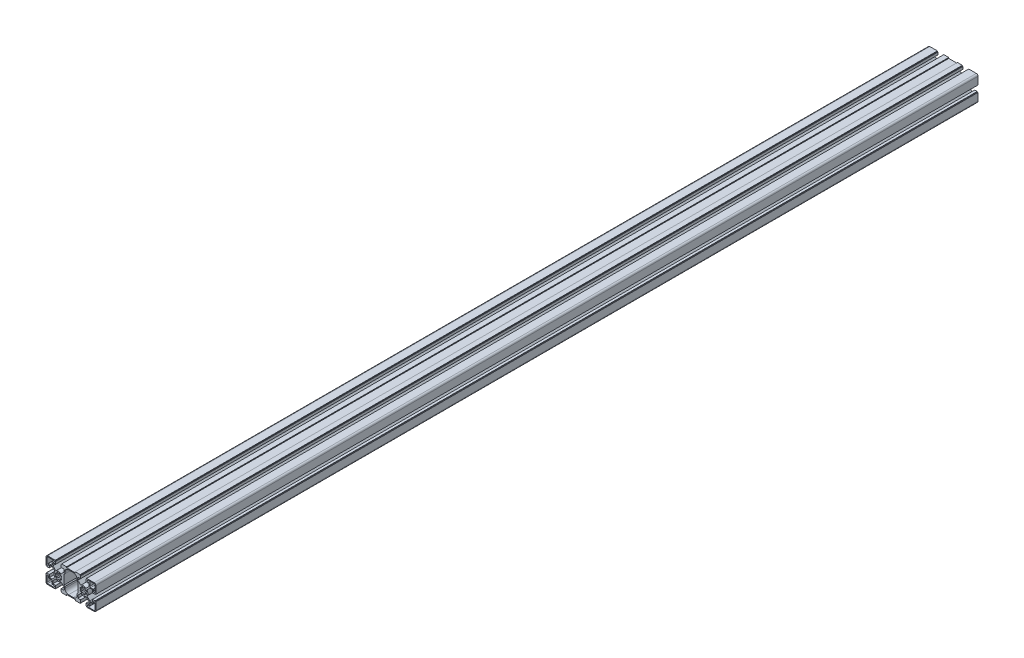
from build123d import *

# Parameters (mm, degrees)
BOSS_EXTRUDE1_DEPTH = 1592.4022


with BuildPart() as part:
    # Sketch1 → Boss-Extrude1 (new body)
    with BuildSketch(Plane.XY):
        with BuildLine():
            Line((-42.0116, 22.5044), (-28.2956, 22.5044))
            Line((-28.2956, 22.5044), (-28.2956, 21.0058))
            Line((-28.2956, 21.0058), (-27.5082, 21.0058))
            Line((-27.5082, 21.0058), (-27.5082, 16.51))
            Line((-27.5082, 16.51), (-32.5501, 16.51))
            Line((-32.5501, 16.51), (-32.5501, 11.680106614))
            Line((-32.5501, 11.680106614), (-27.285426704, 6.415433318))
            ThreePointArc((-27.285426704, 6.415433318), (-22.5044, 8.001), (-17.723373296, 6.415433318))
            Line((-17.723373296, 6.415433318), (-12.4587, 11.680106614))
            Line((-12.4587, 11.680106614), (-12.4587, 16.51))
            Line((-12.4587, 16.51), (-17.5006, 16.51))
            Line((-17.5006, 16.51), (-17.5006, 21.0058))
            Line((-17.5006, 21.0058), (-16.7132, 21.0058))
            Line((-16.7132, 21.0058), (-16.7132, 22.5044))
            Line((-16.7132, 22.5044), (-7.8105, 22.5044))
            Line((-7.8105, 22.5044), (-7.8105, 21.0058))
            Line((-7.8105, 21.0058), (7.8105, 21.0058))
            Line((7.8105, 21.0058), (7.8105, 22.5044))
            Line((7.8105, 22.5044), (16.7132, 22.5044))
            Line((16.7132, 22.5044), (16.7132, 21.0058))
            Line((16.7132, 21.0058), (17.5006, 21.0058))
            Line((17.5006, 21.0058), (17.5006, 16.51))
            Line((17.5006, 16.51), (12.4587, 16.51))
            Line((12.4587, 16.51), (12.4587, 11.680106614))
            Line((12.4587, 11.680106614), (17.723373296, 6.415433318))
            ThreePointArc((17.723373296, 6.415433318), (22.5044, 8.001), (27.285426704, 6.415433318))
            Line((27.285426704, 6.415433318), (32.5501, 11.680106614))
            Line((32.5501, 11.680106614), (32.5501, 16.51))
            Line((32.5501, 16.51), (27.5082, 16.51))
            Line((27.5082, 16.51), (27.5082, 21.0058))
            Line((27.5082, 21.0058), (28.2956, 21.0058))
            Line((28.2956, 21.0058), (28.2956, 22.5044))
            Line((28.2956, 22.5044), (42.0116, 22.5044))
            ThreePointArc((42.0116, 22.5044), (44.130940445, 21.626540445), (45.0088, 19.5072))
            Line((45.0088, 19.5072), (45.0088, 5.7912))
            Line((45.0088, 5.7912), (43.5102, 5.7912))
            Line((43.5102, 5.7912), (43.5102, 5.0038))
            Line((43.5102, 5.0038), (39.0144, 5.0038))
            Line((39.0144, 5.0038), (39.0144, 10.0457))
            Line((39.0144, 10.0457), (34.184506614, 10.0457))
            Line((34.184506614, 10.0457), (28.919833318, 4.781026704))
            ThreePointArc((28.919833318, 4.781026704), (30.5054, 0), (28.919833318, -4.781026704))
            Line((28.919833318, -4.781026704), (34.184506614, -10.0457))
            Line((34.184506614, -10.0457), (39.0144, -10.0457))
            Line((39.0144, -10.0457), (39.0144, -5.0038))
            Line((39.0144, -5.0038), (43.5102, -5.0038))
            Line((43.5102, -5.0038), (43.5102, -5.7912))
            Line((43.5102, -5.7912), (45.0088, -5.7912))
            Line((45.0088, -5.7912), (45.0088, -19.5072))
            ThreePointArc((45.0088, -19.5072), (44.130940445, -21.626540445), (42.0116, -22.5044))
            Line((42.0116, -22.5044), (28.2956, -22.5044))
            Line((28.2956, -22.5044), (28.2956, -21.0058))
            Line((28.2956, -21.0058), (27.5082, -21.0058))
            Line((27.5082, -21.0058), (27.5082, -16.51))
            Line((27.5082, -16.51), (32.5501, -16.51))
            Line((32.5501, -16.51), (32.5501, -11.680106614))
            Line((32.5501, -11.680106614), (27.285426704, -6.415433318))
            ThreePointArc((27.285426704, -6.415433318), (22.5044, -8.001), (17.723373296, -6.415433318))
            Line((17.723373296, -6.415433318), (12.4587, -11.680106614))
            Line((12.4587, -11.680106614), (12.4587, -16.51))
            Line((12.4587, -16.51), (17.5006, -16.51))
            Line((17.5006, -16.51), (17.5006, -21.0058))
            Line((17.5006, -21.0058), (16.7132, -21.0058))
            Line((16.7132, -21.0058), (16.7132, -22.5044))
            Line((16.7132, -22.5044), (7.8105, -22.5044))
            Line((7.8105, -22.5044), (7.8105, -21.0058))
            Line((7.8105, -21.0058), (-7.8105, -21.0058))
            Line((-7.8105, -21.0058), (-7.8105, -22.5044))
            Line((-7.8105, -22.5044), (-16.7132, -22.5044))
            Line((-16.7132, -22.5044), (-16.7132, -21.0058))
            Line((-16.7132, -21.0058), (-17.5006, -21.0058))
            Line((-17.5006, -21.0058), (-17.5006, -16.51))
            Line((-17.5006, -16.51), (-12.4587, -16.51))
            Line((-12.4587, -16.51), (-12.4587, -11.680106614))
            Line((-12.4587, -11.680106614), (-17.723373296, -6.415433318))
            ThreePointArc((-17.723373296, -6.415433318), (-22.5044, -8.001), (-27.285426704, -6.415433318))
            Line((-27.285426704, -6.415433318), (-32.5501, -11.680106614))
            Line((-32.5501, -11.680106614), (-32.5501, -16.51))
            Line((-32.5501, -16.51), (-27.5082, -16.51))
            Line((-27.5082, -16.51), (-27.5082, -21.0058))
            Line((-27.5082, -21.0058), (-28.2956, -21.0058))
            Line((-28.2956, -21.0058), (-28.2956, -22.5044))
            Line((-28.2956, -22.5044), (-42.0116, -22.5044))
            ThreePointArc((-42.0116, -22.5044), (-44.130940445, -21.626540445), (-45.0088, -19.5072))
            Line((-45.0088, -19.5072), (-45.0088, -5.7912))
            Line((-45.0088, -5.7912), (-43.5102, -5.7912))
            Line((-43.5102, -5.7912), (-43.5102, -5.0038))
            Line((-43.5102, -5.0038), (-39.0144, -5.0038))
            Line((-39.0144, -5.0038), (-39.0144, -10.0457))
            Line((-39.0144, -10.0457), (-34.184506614, -10.0457))
            Line((-34.184506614, -10.0457), (-28.919833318, -4.781026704))
            ThreePointArc((-28.919833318, -4.781026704), (-30.5054, 0), (-28.919833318, 4.781026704))
            Line((-28.919833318, 4.781026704), (-34.184506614, 10.0457))
            Line((-34.184506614, 10.0457), (-39.0144, 10.0457))
            Line((-39.0144, 10.0457), (-39.0144, 5.0038))
            Line((-39.0144, 5.0038), (-43.5102, 5.0038))
            Line((-43.5102, 5.0038), (-43.5102, 5.7912))
            Line((-43.5102, 5.7912), (-45.0088, 5.7912))
            Line((-45.0088, 5.7912), (-45.0088, 19.5072))
            ThreePointArc((-45.0088, 19.5072), (-44.130940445, 21.626540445), (-42.0116, 22.5044))
        make_face()
        with BuildLine():
            Line((-40.513, 11.5443), (-35.5473, 11.5443))
            ThreePointArc((-35.5473, 11.5443), (-34.487629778, 11.983229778), (-34.0487, 13.0429))
            Line((-34.0487, 13.0429), (-34.0487, 18.0086))
            Line((-34.0487, 18.0086), (-31.2928, 18.0086))
            ThreePointArc((-31.2928, 18.0086), (-29.7942, 19.5072), (-31.2928, 21.0058))
            Line((-31.2928, 21.0058), (-42.0116, 21.0058))
            ThreePointArc((-42.0116, 21.0058), (-43.071270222, 20.566870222), (-43.5102, 19.5072))
            Line((-43.5102, 19.5072), (-43.5102, 8.7884))
            ThreePointArc((-43.5102, 8.7884), (-42.0116, 7.2898), (-40.513, 8.7884))
            Line((-40.513, 8.7884), (-40.513, 11.5443))
        make_face(mode=Mode.SUBTRACT)
        with BuildLine():
            Line((-21.315129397, 5.978867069), (-21.528207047, 4.907653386))
            ThreePointArc((-21.528207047, 4.907653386), (-22.5044, 5.0038), (-23.480592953, 4.907653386))
            Line((-23.480592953, 4.907653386), (-23.693670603, 5.978867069))
            ThreePointArc((-23.693670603, 5.978867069), (-24.837238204, 5.63196963), (-25.89115614, 5.068638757))
            Line((-25.89115614, 5.068638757), (-25.284362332, 4.160507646))
            ThreePointArc((-25.284362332, 4.160507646), (-26.042620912, 3.538220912), (-26.664907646, 2.779962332))
            Line((-26.664907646, 2.779962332), (-27.573038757, 3.38675614))
            ThreePointArc((-27.573038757, 3.38675614), (-28.13636963, 2.332838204), (-28.483267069, 1.189270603))
            Line((-28.483267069, 1.189270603), (-27.412053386, 0.976192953))
            ThreePointArc((-27.412053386, 0.976192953), (-27.5082, 0), (-27.412053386, -0.976192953))
            Line((-27.412053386, -0.976192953), (-28.483267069, -1.189270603))
            ThreePointArc((-28.483267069, -1.189270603), (-28.13636963, -2.332838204), (-27.573038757, -3.38675614))
            Line((-27.573038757, -3.38675614), (-26.664907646, -2.779962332))
            ThreePointArc((-26.664907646, -2.779962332), (-26.042620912, -3.538220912), (-25.284362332, -4.160507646))
            Line((-25.284362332, -4.160507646), (-25.89115614, -5.068638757))
            ThreePointArc((-25.89115614, -5.068638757), (-24.837238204, -5.63196963), (-23.693670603, -5.978867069))
            Line((-23.693670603, -5.978867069), (-23.480592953, -4.907653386))
            ThreePointArc((-23.480592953, -4.907653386), (-22.5044, -5.0038), (-21.528207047, -4.907653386))
            Line((-21.528207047, -4.907653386), (-21.315129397, -5.978867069))
            ThreePointArc((-21.315129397, -5.978867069), (-20.171561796, -5.63196963), (-19.11764386, -5.068638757))
            Line((-19.11764386, -5.068638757), (-19.724437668, -4.160507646))
            ThreePointArc((-19.724437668, -4.160507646), (-18.966179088, -3.538220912), (-18.343892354, -2.779962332))
            Line((-18.343892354, -2.779962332), (-17.435761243, -3.38675614))
            ThreePointArc((-17.435761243, -3.38675614), (-16.87243037, -2.332838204), (-16.525532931, -1.189270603))
            Line((-16.525532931, -1.189270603), (-17.596746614, -0.976192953))
            ThreePointArc((-17.596746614, -0.976192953), (-17.5006, 0), (-17.596746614, 0.976192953))
            Line((-17.596746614, 0.976192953), (-16.525532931, 1.189270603))
            ThreePointArc((-16.525532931, 1.189270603), (-16.87243037, 2.332838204), (-17.435761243, 3.38675614))
            Line((-17.435761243, 3.38675614), (-18.343892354, 2.779962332))
            ThreePointArc((-18.343892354, 2.779962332), (-18.966179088, 3.538220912), (-19.724437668, 4.160507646))
            Line((-19.724437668, 4.160507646), (-19.11764386, 5.068638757))
            ThreePointArc((-19.11764386, 5.068638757), (-20.171561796, 5.63196963), (-21.315129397, 5.978867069))
        make_face(mode=Mode.SUBTRACT)
        with BuildLine():
            Line((-10.9601, 9.909893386), (-12.4587, 8.411293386))
            Line((-12.4587, 8.411293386), (-12.4587, -8.411293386))
            Line((-12.4587, -8.411293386), (-10.9601, -9.909893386))
            Line((-10.9601, -9.909893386), (-10.9601, -12.9032))
            ThreePointArc((-10.9601, -12.9032), (-9.025833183, -17.572933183), (-4.3561, -19.5072))
            Line((-4.3561, -19.5072), (4.3561, -19.5072))
            ThreePointArc((4.3561, -19.5072), (9.025833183, -17.572933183), (10.9601, -12.9032))
            Line((10.9601, -12.9032), (10.9601, -9.909893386))
            Line((10.9601, -9.909893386), (12.4587, -8.411293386))
            Line((12.4587, -8.411293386), (12.4587, 8.411293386))
            Line((12.4587, 8.411293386), (10.9601, 9.909893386))
            Line((10.9601, 9.909893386), (10.9601, 12.9032))
            ThreePointArc((10.9601, 12.9032), (9.025833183, 17.572933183), (4.3561, 19.5072))
            Line((4.3561, 19.5072), (-4.3561, 19.5072))
            ThreePointArc((-4.3561, 19.5072), (-9.025833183, 17.572933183), (-10.9601, 12.9032))
            Line((-10.9601, 12.9032), (-10.9601, 9.909893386))
        make_face(mode=Mode.SUBTRACT)
        with BuildLine():
            Line((-40.513, -11.5443), (-35.5473, -11.5443))
            ThreePointArc((-35.5473, -11.5443), (-34.487629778, -11.983229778), (-34.0487, -13.0429))
            Line((-34.0487, -13.0429), (-34.0487, -18.0086))
            Line((-34.0487, -18.0086), (-31.2928, -18.0086))
            ThreePointArc((-31.2928, -18.0086), (-29.7942, -19.5072), (-31.2928, -21.0058))
            Line((-31.2928, -21.0058), (-42.0116, -21.0058))
            ThreePointArc((-42.0116, -21.0058), (-43.071270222, -20.566870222), (-43.5102, -19.5072))
            Line((-43.5102, -19.5072), (-43.5102, -8.7884))
            ThreePointArc((-43.5102, -8.7884), (-42.0116, -7.2898), (-40.513, -8.7884))
            Line((-40.513, -8.7884), (-40.513, -11.5443))
        make_face(mode=Mode.SUBTRACT)
        with BuildLine():
            Line((42.0116, 21.0058), (31.2928, 21.0058))
            ThreePointArc((31.2928, 21.0058), (29.7942, 19.5072), (31.2928, 18.0086))
            Line((31.2928, 18.0086), (34.0487, 18.0086))
            Line((34.0487, 18.0086), (34.0487, 13.0429))
            ThreePointArc((34.0487, 13.0429), (34.487629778, 11.983229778), (35.5473, 11.5443))
            Line((35.5473, 11.5443), (40.513, 11.5443))
            Line((40.513, 11.5443), (40.513, 8.7884))
            ThreePointArc((40.513, 8.7884), (42.0116, 7.2898), (43.5102, 8.7884))
            Line((43.5102, 8.7884), (43.5102, 19.5072))
            ThreePointArc((43.5102, 19.5072), (43.071270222, 20.566870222), (42.0116, 21.0058))
        make_face(mode=Mode.SUBTRACT)
        with BuildLine():
            Line((40.513, -11.5443), (35.5473, -11.5443))
            ThreePointArc((35.5473, -11.5443), (34.487629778, -11.983229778), (34.0487, -13.0429))
            Line((34.0487, -13.0429), (34.0487, -18.0086))
            Line((34.0487, -18.0086), (31.2928, -18.0086))
            ThreePointArc((31.2928, -18.0086), (29.7942, -19.5072), (31.2928, -21.0058))
            Line((31.2928, -21.0058), (42.0116, -21.0058))
            ThreePointArc((42.0116, -21.0058), (43.071270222, -20.566870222), (43.5102, -19.5072))
            Line((43.5102, -19.5072), (43.5102, -8.7884))
            ThreePointArc((43.5102, -8.7884), (42.0116, -7.2898), (40.513, -8.7884))
            Line((40.513, -8.7884), (40.513, -11.5443))
        make_face(mode=Mode.SUBTRACT)
        with BuildLine():
            Line((27.573038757, 3.38675614), (26.664907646, 2.779962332))
            ThreePointArc((26.664907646, 2.779962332), (26.042620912, 3.538220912), (25.284362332, 4.160507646))
            Line((25.284362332, 4.160507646), (25.89115614, 5.068638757))
            ThreePointArc((25.89115614, 5.068638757), (24.837238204, 5.63196963), (23.693670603, 5.978867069))
            Line((23.693670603, 5.978867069), (23.480592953, 4.907653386))
            ThreePointArc((23.480592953, 4.907653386), (22.5044, 5.0038), (21.528207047, 4.907653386))
            Line((21.528207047, 4.907653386), (21.315129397, 5.978867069))
            ThreePointArc((21.315129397, 5.978867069), (20.171561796, 5.63196963), (19.11764386, 5.068638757))
            Line((19.11764386, 5.068638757), (19.724437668, 4.160507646))
            ThreePointArc((19.724437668, 4.160507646), (18.966179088, 3.538220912), (18.343892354, 2.779962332))
            Line((18.343892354, 2.779962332), (17.435761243, 3.38675614))
            ThreePointArc((17.435761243, 3.38675614), (16.87243037, 2.332838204), (16.525532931, 1.189270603))
            Line((16.525532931, 1.189270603), (17.596746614, 0.976192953))
            ThreePointArc((17.596746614, 0.976192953), (17.5006, 0), (17.596746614, -0.976192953))
            Line((17.596746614, -0.976192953), (16.525532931, -1.189270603))
            ThreePointArc((16.525532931, -1.189270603), (16.87243037, -2.332838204), (17.435761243, -3.38675614))
            Line((17.435761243, -3.38675614), (18.343892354, -2.779962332))
            ThreePointArc((18.343892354, -2.779962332), (18.966179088, -3.538220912), (19.724437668, -4.160507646))
            Line((19.724437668, -4.160507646), (19.11764386, -5.068638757))
            ThreePointArc((19.11764386, -5.068638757), (20.171561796, -5.63196963), (21.315129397, -5.978867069))
            Line((21.315129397, -5.978867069), (21.528207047, -4.907653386))
            ThreePointArc((21.528207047, -4.907653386), (22.5044, -5.0038), (23.480592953, -4.907653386))
            Line((23.480592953, -4.907653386), (23.693670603, -5.978867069))
            ThreePointArc((23.693670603, -5.978867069), (24.837238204, -5.63196963), (25.89115614, -5.068638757))
            Line((25.89115614, -5.068638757), (25.284362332, -4.160507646))
            ThreePointArc((25.284362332, -4.160507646), (26.042620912, -3.538220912), (26.664907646, -2.779962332))
            Line((26.664907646, -2.779962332), (27.573038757, -3.38675614))
            ThreePointArc((27.573038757, -3.38675614), (28.13636963, -2.332838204), (28.483267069, -1.189270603))
            Line((28.483267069, -1.189270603), (27.412053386, -0.976192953))
            ThreePointArc((27.412053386, -0.976192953), (27.5082, 0), (27.412053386, 0.976192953))
            Line((27.412053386, 0.976192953), (28.483267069, 1.189270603))
            ThreePointArc((28.483267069, 1.189270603), (28.13636963, 2.332838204), (27.573038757, 3.38675614))
        make_face(mode=Mode.SUBTRACT)
    extrude(amount=BOSS_EXTRUDE1_DEPTH)


solid = part.part
